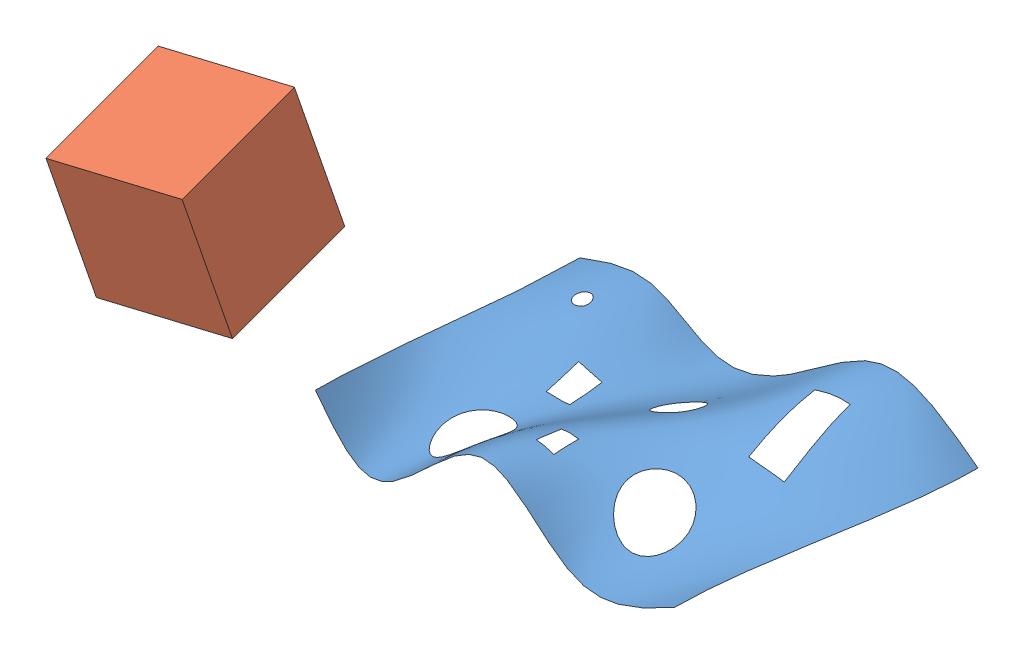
SolidWorks assembly Surfacing_Intro.SLDASM, configuration Default (file format 3100). Lengths in mm.
Overall size (471.93 132.02 158.84).
2 component instances, 2 part files, 0 mates.
Components (placement in the parent):
- Surfaces - Delete Hole-1: Surfaces - Delete Hole.SLDPRT [Default] at (-11.3136 -50.9186 40.5634) size (243.13 64.35 146.03)
- IntroCube-1: IntroCube.SLDPRT [Default] at (-300.7137 -88.5675 -70.0506) x (0.980938 0.181994 -0.068111) z (0.106508 -0.210376 0.971801) size (76.2 76.2 76.2)
